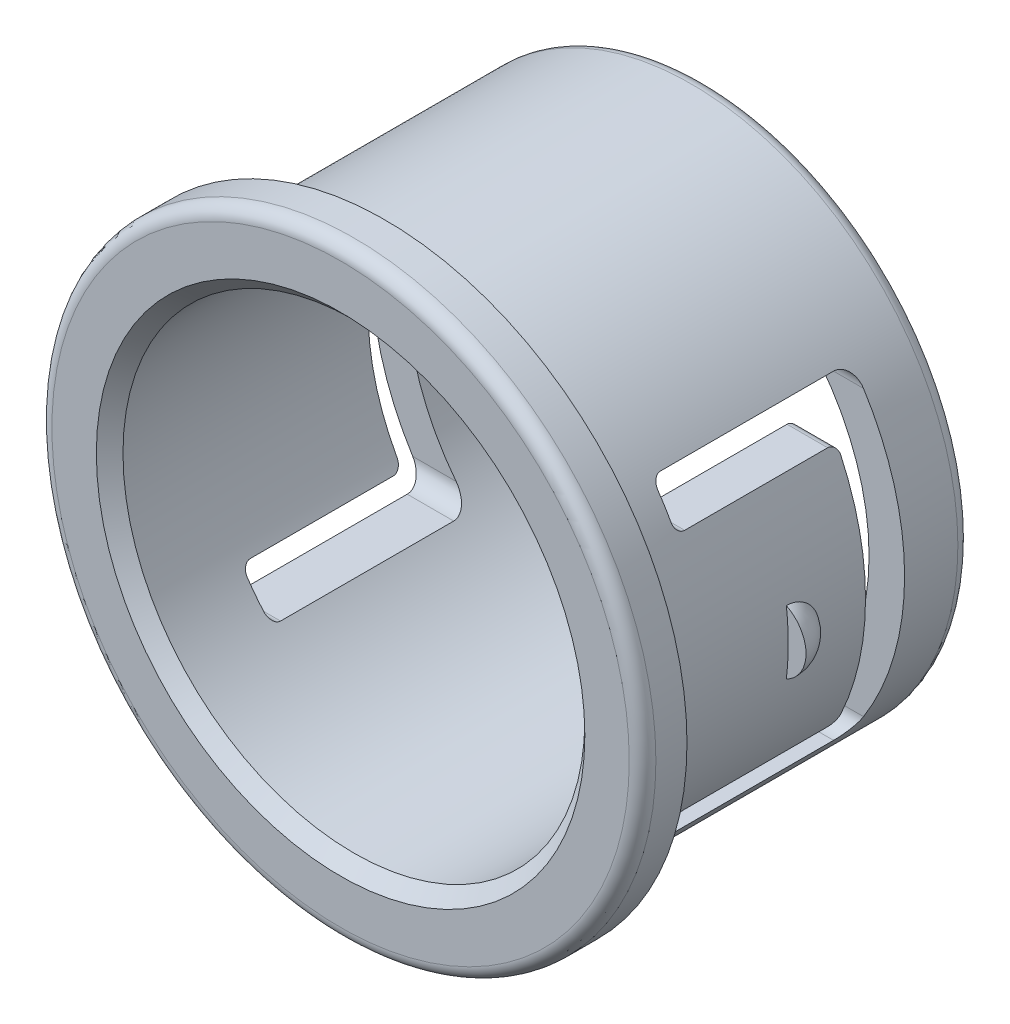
from build123d import *

# Parameters (mm, degrees)
ESQUISSE1_R                  = 15
ESQUISSE1_R_2                = 13
BASE_EXTRUSION_DEPTH         = 18
BOSS_EXTRU_1_START           = 2.5
ESQUISSE2_R                  = 17
ESQUISSE2_R_2                = 13
BOSS_EXTRU_1_DEPTH           = 2.5
CONG_1_R                     = 0.75
CHANFREIN2_SIZE              = 0.75
ENL_V_MAT_EXTRU_1_DEPTH      = 31.033314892
ENL_V_MAT_EXTRU_1_DEPTH_BACK = 31.033314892
BOSS_R_VOL_1_ANGLE           = 90
R_P_TITION_CIRCULAIRE1_COUNT = 2


with BuildPart() as part:
    # Esquisse1 → Base-Extrusion (new body)
    with BuildSketch(Plane.XY):
        Circle(ESQUISSE1_R)
        Circle(ESQUISSE1_R_2, mode=Mode.SUBTRACT)
    extrude(amount=-BASE_EXTRUSION_DEPTH)

    # Esquisse2 → Boss.-Extru.1 (add)
    with BuildSketch(Plane.XY.offset(BOSS_EXTRU_1_START)):
        Circle(ESQUISSE2_R)
        Circle(ESQUISSE2_R_2, mode=Mode.SUBTRACT)
    extrude(amount=-BOSS_EXTRU_1_DEPTH)

    # Cong_1
    cong_1_edges = [part.edges().sort_by_distance(p)[0] for p in [
        (-15, 0, -18),
        (-17, 0, 2.5),
    ]]
    fillet(cong_1_edges, radius=CONG_1_R)

    # Chanfrein2
    chanfrein2_edges = [part.edges().sort_by_distance(p)[0] for p in [
        (-13, 0, -18),
        (-13, 0, 2.5),
    ]]
    chamfer(chanfrein2_edges, length=CHANFREIN2_SIZE)

    # Esquisse3 → Enl_v. mat.-Extru.1 (cut, two sides: drawn at the far end of the back side and taken through both)
    with BuildSketch(Plane(origin=(0, 0, 0), x_dir=(0, 0, -1), z_dir=(1, 0, 0)).offset(-ENL_V_MAT_EXTRU_1_DEPTH_BACK)):
        with BuildLine():
            Line((14.25, -8), (14.25, 8))
            ThreePointArc((14.25, 8), (13.957106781, 8.707106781), (13.25, 9))
            Line((13.25, 9), (3.5, 9))
            ThreePointArc((3.5, 9), (3.146446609, 8.853553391), (3, 8.5))
            Line((3, 8.5), (3, 7.3))
            ThreePointArc((3, 7.3), (3.146446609, 6.946446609), (3.5, 6.8))
            Line((3.5, 6.8), (11.55, 6.8))
            ThreePointArc((11.55, 6.8), (11.903553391, 6.653553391), (12.05, 6.3))
            Line((12.05, 6.3), (12.05, -6.3))
            ThreePointArc((12.05, -6.3), (11.903553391, -6.653553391), (11.55, -6.8))
            Line((11.55, -6.8), (3.5, -6.8))
            ThreePointArc((3.5, -6.8), (3.146446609, -6.946446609), (3, -7.3))
            Line((3, -7.3), (3, -8.5))
            ThreePointArc((3, -8.5), (3.146446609, -8.853553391), (3.5, -9))
            Line((3.5, -9), (13.25, -9))
            ThreePointArc((13.25, -9), (13.957106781, -8.707106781), (14.25, -8))
        make_face()
    extrude(amount=ENL_V_MAT_EXTRU_1_DEPTH + ENL_V_MAT_EXTRU_1_DEPTH_BACK, mode=Mode.SUBTRACT)

    # Esquisse4 → Boss.-R_vol.1 (revolve)
    with BuildSketch(Plane.XY.offset(-7.7)):
        with BuildLine():
            Line((-14, 2), (-14, -2))
            ThreePointArc((-14, -2), (-16, 0), (-14, 2))
        make_face()
    boss_r_vol_1 = revolve(axis=Axis((-14, 15, -7.7), (0, -1, 0)), revolution_arc=BOSS_R_VOL_1_ANGLE)

    # R_p_tition circulaire1: Boss.-R_vol.1 ×2 about axis
    r_p_tition_circulaire1_axis = Axis((0, 0, 0), (0, 0, 1))
    for i in range(1, R_P_TITION_CIRCULAIRE1_COUNT):
        add(boss_r_vol_1.rotate(r_p_tition_circulaire1_axis, i * 360 / R_P_TITION_CIRCULAIRE1_COUNT))


solid = part.part
